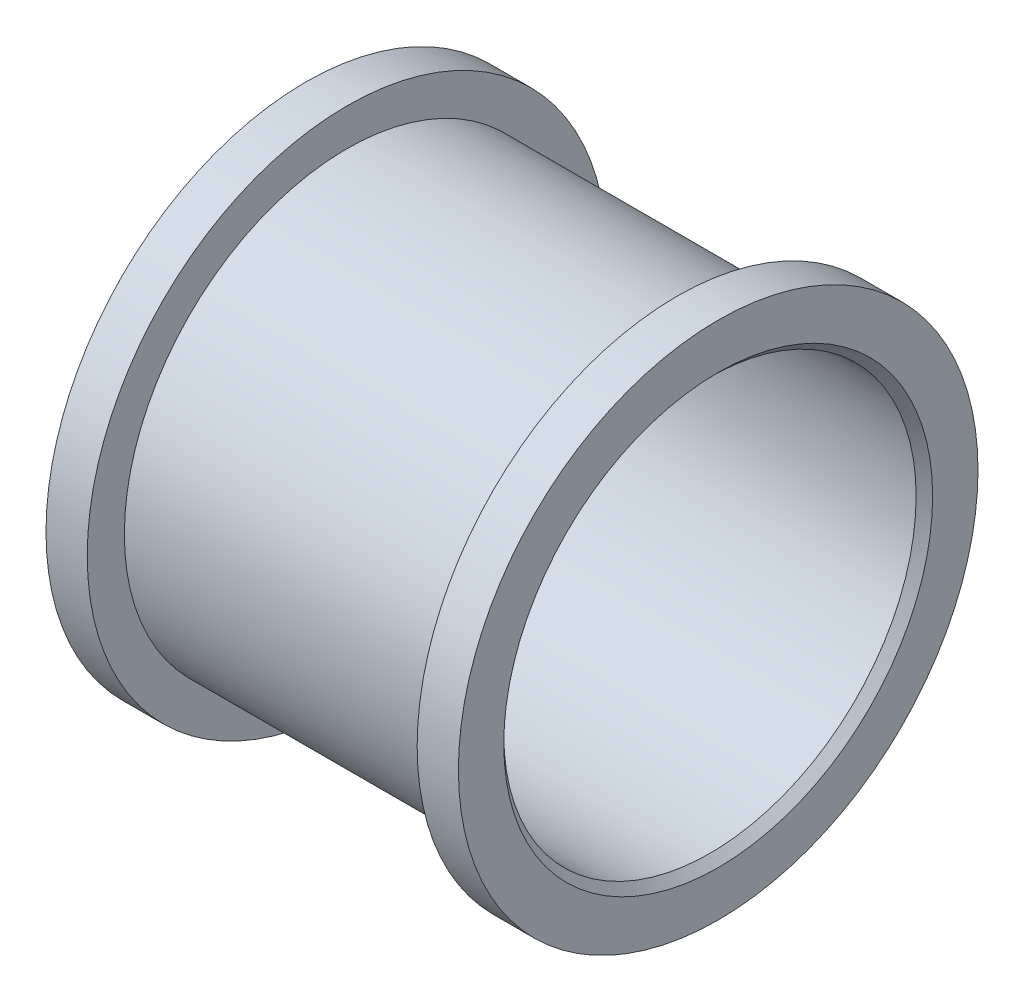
from build123d import *

# Parameters (mm, degrees)
CHANFREIN1_SIZE = 0.1


with BuildPart() as part:
    # Esquisse1 → R_volution1 (revolve)
    with BuildSketch(Plane.XY, mode=Mode.PRIVATE) as r_volution1_sk:
        Polygon((0, 2.5), (5, 2.5), (5, 3.15), (4.5, 3.15), (4.5, 2.7), (0.5, 2.7), (0.5, 3.15), (0, 3.15), align=None)
    revolve(r_volution1_sk.sketch.rotate(Axis((-47.649612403, 0, 0), (1, 0, 0)), 90), axis=Axis((-47.649612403, 0, 0), (1, 0, 0)))

    # Chanfrein1
    chanfrein1_edges = [part.edges().sort_by_distance(p)[0] for p in [
        (0, 0, -2.5),
        (5, 0, -2.5),
    ]]
    chamfer(chanfrein1_edges, length=CHANFREIN1_SIZE)


solid = part.part
